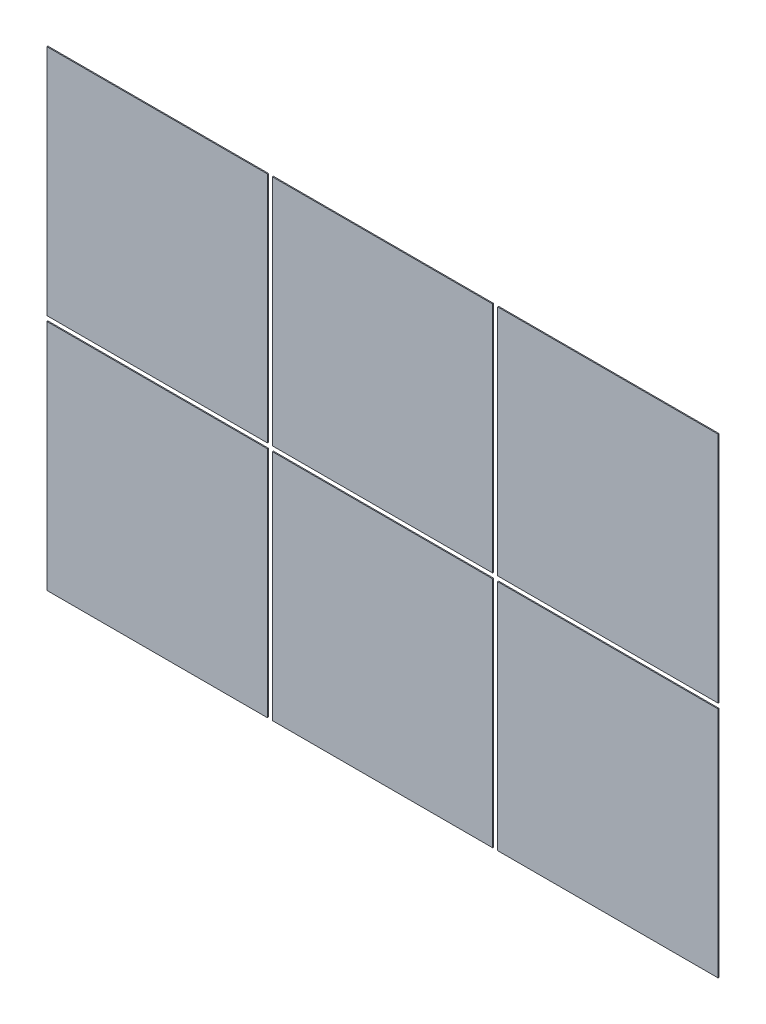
ISO-10303-21;
HEADER;
FILE_DESCRIPTION(('STEP AP214'),'2;1');
FILE_NAME('part.step','',(''),(''),'','','');
FILE_SCHEMA(('AUTOMOTIVE_DESIGN { 1 0 10303 214 1 1 1 1 }'));
ENDSEC;
DATA;
#1=APPLICATION_CONTEXT('core data for automotive mechanical design processes');
#2=APPLICATION_PROTOCOL_DEFINITION('international standard','automotive_design',2000,#1);
#3=PRODUCT_CONTEXT('',#1,'mechanical');
#4=PRODUCT('Part','Part','',(#3));
#5=PRODUCT_RELATED_PRODUCT_CATEGORY('part','',(#4));
#6=PRODUCT_DEFINITION_FORMATION('','',#4);
#7=PRODUCT_DEFINITION_CONTEXT('part definition',#1,'design');
#8=PRODUCT_DEFINITION('design','',#6,#7);
#9=PRODUCT_DEFINITION_SHAPE('','',#8);
#10=(LENGTH_UNIT() NAMED_UNIT(*) SI_UNIT(.MILLI.,.METRE.));
#11=(NAMED_UNIT(*) PLANE_ANGLE_UNIT() SI_UNIT($,.RADIAN.));
#12=(NAMED_UNIT(*) SI_UNIT($,.STERADIAN.) SOLID_ANGLE_UNIT());
#13=UNCERTAINTY_MEASURE_WITH_UNIT(LENGTH_MEASURE(1.E-05),#10,'distance_accuracy_value','');
#14=(GEOMETRIC_REPRESENTATION_CONTEXT(3) GLOBAL_UNCERTAINTY_ASSIGNED_CONTEXT((#13)) GLOBAL_UNIT_ASSIGNED_CONTEXT((#10,
#11,#12)) REPRESENTATION_CONTEXT('',''));
#15=CARTESIAN_POINT('',(0.,0.,0.));
#16=DIRECTION('',(0.,0.,1.));
#17=DIRECTION('',(1.,0.,0.));
#18=AXIS2_PLACEMENT_3D('',#15,#16,#17);
#19=CARTESIAN_POINT('',(-460.,-960.,0.0999999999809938));
#20=DIRECTION('',(-1.,0.,0.));
#21=DIRECTION('',(0.,0.,1.));
#22=AXIS2_PLACEMENT_3D('',#19,#20,#21);
#23=PLANE('',#22);
#24=DIRECTION('',(0.,-1.,0.));
#25=VECTOR('',#24,1.);
#26=CARTESIAN_POINT('',(-460.,-960.,4.09999999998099));
#27=LINE('',#26,#25);
#28=CARTESIAN_POINT('',(-460.,-960.,4.09999999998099));
#29=VERTEX_POINT('',#28);
#30=CARTESIAN_POINT('',(-460.,-1890.,4.09999999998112));
#31=VERTEX_POINT('',#30);
#32=EDGE_CURVE('E113',#29,#31,#27,.T.);
#33=ORIENTED_EDGE('',*,*,#32,.T.);
#34=DIRECTION('',(0.,0.,1.));
#35=VECTOR('',#34,1.);
#36=CARTESIAN_POINT('',(-460.,-1890.,0.0999999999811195));
#37=LINE('',#36,#35);
#38=CARTESIAN_POINT('',(-460.,-1890.,0.0999999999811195));
#39=VERTEX_POINT('',#38);
#40=EDGE_CURVE('E12',#39,#31,#37,.T.);
#41=ORIENTED_EDGE('',*,*,#40,.F.);
#42=DIRECTION('',(0.,-1.,0.));
#43=VECTOR('',#42,1.);
#44=CARTESIAN_POINT('',(-460.,-960.,0.0999999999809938));
#45=LINE('',#44,#43);
#46=CARTESIAN_POINT('',(-460.,-960.,0.0999999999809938));
#47=VERTEX_POINT('',#46);
#48=EDGE_CURVE('E101',#47,#39,#45,.T.);
#49=ORIENTED_EDGE('',*,*,#48,.F.);
#50=DIRECTION('',(0.,0.,1.));
#51=VECTOR('',#50,1.);
#52=CARTESIAN_POINT('',(-460.,-960.,0.0999999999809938));
#53=LINE('',#52,#51);
#54=EDGE_CURVE('E109',#47,#29,#53,.T.);
#55=ORIENTED_EDGE('',*,*,#54,.T.);
#56=EDGE_LOOP('',(#33,#41,#49,#55));
#57=FACE_BOUND('',#56,.T.);
#58=ADVANCED_FACE('F50',(#57),#23,.F.);
#59=CARTESIAN_POINT('',(-460.,-1890.,0.0999999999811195));
#60=DIRECTION('',(0.,1.,0.));
#61=DIRECTION('',(0.,0.,1.));
#62=AXIS2_PLACEMENT_3D('',#59,#60,#61);
#63=PLANE('',#62);
#64=DIRECTION('',(-1.,0.,0.));
#65=VECTOR('',#64,1.);
#66=CARTESIAN_POINT('',(-460.,-1890.,4.09999999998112));
#67=LINE('',#66,#65);
#68=CARTESIAN_POINT('',(-1340.,-1890.,4.09999999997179));
#69=VERTEX_POINT('',#68);
#70=EDGE_CURVE('E105',#31,#69,#67,.T.);
#71=ORIENTED_EDGE('',*,*,#70,.T.);
#72=DIRECTION('',(0.,0.,1.));
#73=VECTOR('',#72,1.);
#74=CARTESIAN_POINT('',(-1340.,-1890.,0.0999999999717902));
#75=LINE('',#74,#73);
#76=CARTESIAN_POINT('',(-1340.,-1890.,0.0999999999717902));
#77=VERTEX_POINT('',#76);
#78=EDGE_CURVE('E58',#77,#69,#75,.T.);
#79=ORIENTED_EDGE('',*,*,#78,.F.);
#80=DIRECTION('',(-1.,0.,0.));
#81=VECTOR('',#80,1.);
#82=CARTESIAN_POINT('',(-460.,-1890.,0.0999999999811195));
#83=LINE('',#82,#81);
#84=EDGE_CURVE('E96',#39,#77,#83,.T.);
#85=ORIENTED_EDGE('',*,*,#84,.F.);
#86=ORIENTED_EDGE('',*,*,#40,.T.);
#87=EDGE_LOOP('',(#71,#79,#85,#86));
#88=FACE_BOUND('',#87,.T.);
#89=ADVANCED_FACE('F104',(#88),#63,.F.);
#90=CARTESIAN_POINT('',(-1340.,-960.,0.0999999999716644));
#91=DIRECTION('',(1.,0.,0.));
#92=DIRECTION('',(0.,0.,-1.));
#93=AXIS2_PLACEMENT_3D('',#90,#91,#92);
#94=PLANE('',#93);
#95=DIRECTION('',(0.,1.,0.));
#96=VECTOR('',#95,1.);
#97=CARTESIAN_POINT('',(-1340.,-960.,4.09999999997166));
#98=LINE('',#97,#96);
#99=CARTESIAN_POINT('',(-1340.,-960.,4.09999999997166));
#100=VERTEX_POINT('',#99);
#101=EDGE_CURVE('E83',#69,#100,#98,.T.);
#102=ORIENTED_EDGE('',*,*,#101,.T.);
#103=DIRECTION('',(0.,0.,1.));
#104=VECTOR('',#103,1.);
#105=CARTESIAN_POINT('',(-1340.,-960.,0.0999999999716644));
#106=LINE('',#105,#104);
#107=CARTESIAN_POINT('',(-1340.,-960.,0.0999999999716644));
#108=VERTEX_POINT('',#107);
#109=EDGE_CURVE('E106',#108,#100,#106,.T.);
#110=ORIENTED_EDGE('',*,*,#109,.F.);
#111=DIRECTION('',(0.,1.,0.));
#112=VECTOR('',#111,1.);
#113=CARTESIAN_POINT('',(-1340.,-960.,0.0999999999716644));
#114=LINE('',#113,#112);
#115=EDGE_CURVE('E99',#77,#108,#114,.T.);
#116=ORIENTED_EDGE('',*,*,#115,.F.);
#117=ORIENTED_EDGE('',*,*,#78,.T.);
#118=EDGE_LOOP('',(#102,#110,#116,#117));
#119=FACE_BOUND('',#118,.T.);
#120=ADVANCED_FACE('F107',(#119),#94,.F.);
#121=CARTESIAN_POINT('',(-460.,-960.,0.0999999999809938));
#122=DIRECTION('',(0.,-1.,0.));
#123=DIRECTION('',(0.,0.,-1.));
#124=AXIS2_PLACEMENT_3D('',#121,#122,#123);
#125=PLANE('',#124);
#126=DIRECTION('',(1.,0.,0.));
#127=VECTOR('',#126,1.);
#128=CARTESIAN_POINT('',(-460.,-960.,4.09999999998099));
#129=LINE('',#128,#127);
#130=EDGE_CURVE('E89',#100,#29,#129,.T.);
#131=ORIENTED_EDGE('',*,*,#130,.T.);
#132=ORIENTED_EDGE('',*,*,#54,.F.);
#133=DIRECTION('',(1.,0.,0.));
#134=VECTOR('',#133,1.);
#135=CARTESIAN_POINT('',(-460.,-960.,0.0999999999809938));
#136=LINE('',#135,#134);
#137=EDGE_CURVE('E66',#108,#47,#136,.T.);
#138=ORIENTED_EDGE('',*,*,#137,.F.);
#139=ORIENTED_EDGE('',*,*,#109,.T.);
#140=EDGE_LOOP('',(#131,#132,#138,#139));
#141=FACE_BOUND('',#140,.T.);
#142=ADVANCED_FACE('F120',(#141),#125,.F.);
#143=CARTESIAN_POINT('',(0.,0.,0.0999999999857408));
#144=DIRECTION('',(0.,0.,-1.));
#145=DIRECTION('',(-1.,0.,0.));
#146=AXIS2_PLACEMENT_3D('',#143,#144,#145);
#147=PLANE('',#146);
#148=ORIENTED_EDGE('',*,*,#48,.T.);
#149=ORIENTED_EDGE('',*,*,#84,.T.);
#150=ORIENTED_EDGE('',*,*,#115,.T.);
#151=ORIENTED_EDGE('',*,*,#137,.T.);
#152=EDGE_LOOP('',(#148,#149,#150,#151));
#153=FACE_BOUND('',#152,.T.);
#154=ADVANCED_FACE('F97',(#153),#147,.T.);
#155=CARTESIAN_POINT('',(0.,0.,4.09999999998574));
#156=DIRECTION('',(0.,0.,-1.));
#157=DIRECTION('',(-1.,0.,0.));
#158=AXIS2_PLACEMENT_3D('',#155,#156,#157);
#159=PLANE('',#158);
#160=ORIENTED_EDGE('',*,*,#32,.F.);
#161=ORIENTED_EDGE('',*,*,#130,.F.);
#162=ORIENTED_EDGE('',*,*,#101,.F.);
#163=ORIENTED_EDGE('',*,*,#70,.F.);
#164=EDGE_LOOP('',(#160,#161,#162,#163));
#165=FACE_BOUND('',#164,.T.);
#166=ADVANCED_FACE('F123',(#165),#159,.F.);
#167=CLOSED_SHELL('',(#58,#89,#120,#142,#154,#166));
#168=MANIFOLD_SOLID_BREP('B2',#167);
#169=CARTESIAN_POINT('',(440.,-1890.,0.0999999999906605));
#170=DIRECTION('',(-1.,0.,0.));
#171=DIRECTION('',(0.,0.,1.));
#172=AXIS2_PLACEMENT_3D('',#169,#170,#171);
#173=PLANE('',#172);
#174=DIRECTION('',(0.,-1.,0.));
#175=VECTOR('',#174,1.);
#176=CARTESIAN_POINT('',(440.,-1890.,4.09999999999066));
#177=LINE('',#176,#175);
#178=CARTESIAN_POINT('',(440.,-960.,4.09999999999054));
#179=VERTEX_POINT('',#178);
#180=CARTESIAN_POINT('',(440.,-1890.,4.09999999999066));
#181=VERTEX_POINT('',#180);
#182=EDGE_CURVE('E247',#179,#181,#177,.T.);
#183=ORIENTED_EDGE('',*,*,#182,.T.);
#184=DIRECTION('',(0.,0.,1.));
#185=VECTOR('',#184,1.);
#186=CARTESIAN_POINT('',(440.,-1890.,0.0999999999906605));
#187=LINE('',#186,#185);
#188=CARTESIAN_POINT('',(440.,-1890.,0.0999999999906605));
#189=VERTEX_POINT('',#188);
#190=EDGE_CURVE('E48',#189,#181,#187,.T.);
#191=ORIENTED_EDGE('',*,*,#190,.F.);
#192=DIRECTION('',(0.,-1.,0.));
#193=VECTOR('',#192,1.);
#194=CARTESIAN_POINT('',(440.,-1890.,0.0999999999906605));
#195=LINE('',#194,#193);
#196=CARTESIAN_POINT('',(440.,-960.,0.0999999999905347));
#197=VERTEX_POINT('',#196);
#198=EDGE_CURVE('E235',#197,#189,#195,.T.);
#199=ORIENTED_EDGE('',*,*,#198,.F.);
#200=DIRECTION('',(0.,0.,1.));
#201=VECTOR('',#200,1.);
#202=CARTESIAN_POINT('',(440.,-960.,0.0999999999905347));
#203=LINE('',#202,#201);
#204=EDGE_CURVE('E243',#197,#179,#203,.T.);
#205=ORIENTED_EDGE('',*,*,#204,.T.);
#206=EDGE_LOOP('',(#183,#191,#199,#205));
#207=FACE_BOUND('',#206,.T.);
#208=ADVANCED_FACE('F184',(#207),#173,.F.);
#209=CARTESIAN_POINT('',(440.,-1890.,0.0999999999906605));
#210=DIRECTION('',(0.,1.,0.));
#211=DIRECTION('',(0.,0.,1.));
#212=AXIS2_PLACEMENT_3D('',#209,#210,#211);
#213=PLANE('',#212);
#214=DIRECTION('',(-1.,0.,0.));
#215=VECTOR('',#214,1.);
#216=CARTESIAN_POINT('',(440.,-1890.,4.09999999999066));
#217=LINE('',#216,#215);
#218=CARTESIAN_POINT('',(-440.,-1890.,4.09999999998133));
#219=VERTEX_POINT('',#218);
#220=EDGE_CURVE('E239',#181,#219,#217,.T.);
#221=ORIENTED_EDGE('',*,*,#220,.T.);
#222=DIRECTION('',(0.,0.,1.));
#223=VECTOR('',#222,1.);
#224=CARTESIAN_POINT('',(-440.,-1890.,0.0999999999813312));
#225=LINE('',#224,#223);
#226=CARTESIAN_POINT('',(-440.,-1890.,0.0999999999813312));
#227=VERTEX_POINT('',#226);
#228=EDGE_CURVE('E192',#227,#219,#225,.T.);
#229=ORIENTED_EDGE('',*,*,#228,.F.);
#230=DIRECTION('',(-1.,0.,0.));
#231=VECTOR('',#230,1.);
#232=CARTESIAN_POINT('',(440.,-1890.,0.0999999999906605));
#233=LINE('',#232,#231);
#234=EDGE_CURVE('E230',#189,#227,#233,.T.);
#235=ORIENTED_EDGE('',*,*,#234,.F.);
#236=ORIENTED_EDGE('',*,*,#190,.T.);
#237=EDGE_LOOP('',(#221,#229,#235,#236));
#238=FACE_BOUND('',#237,.T.);
#239=ADVANCED_FACE('F238',(#238),#213,.F.);
#240=CARTESIAN_POINT('',(-440.,-1890.,0.0999999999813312));
#241=DIRECTION('',(1.,0.,0.));
#242=DIRECTION('',(0.,0.,-1.));
#243=AXIS2_PLACEMENT_3D('',#240,#241,#242);
#244=PLANE('',#243);
#245=DIRECTION('',(0.,1.,0.));
#246=VECTOR('',#245,1.);
#247=CARTESIAN_POINT('',(-440.,-1890.,4.09999999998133));
#248=LINE('',#247,#246);
#249=CARTESIAN_POINT('',(-440.,-960.,4.09999999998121));
#250=VERTEX_POINT('',#249);
#251=EDGE_CURVE('E217',#219,#250,#248,.T.);
#252=ORIENTED_EDGE('',*,*,#251,.T.);
#253=DIRECTION('',(0.,0.,1.));
#254=VECTOR('',#253,1.);
#255=CARTESIAN_POINT('',(-440.,-960.,0.0999999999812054));
#256=LINE('',#255,#254);
#257=CARTESIAN_POINT('',(-440.,-960.,0.0999999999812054));
#258=VERTEX_POINT('',#257);
#259=EDGE_CURVE('E240',#258,#250,#256,.T.);
#260=ORIENTED_EDGE('',*,*,#259,.F.);
#261=DIRECTION('',(0.,1.,0.));
#262=VECTOR('',#261,1.);
#263=CARTESIAN_POINT('',(-440.,-1890.,0.0999999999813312));
#264=LINE('',#263,#262);
#265=EDGE_CURVE('E233',#227,#258,#264,.T.);
#266=ORIENTED_EDGE('',*,*,#265,.F.);
#267=ORIENTED_EDGE('',*,*,#228,.T.);
#268=EDGE_LOOP('',(#252,#260,#266,#267));
#269=FACE_BOUND('',#268,.T.);
#270=ADVANCED_FACE('F241',(#269),#244,.F.);
#271=CARTESIAN_POINT('',(440.,-960.,0.0999999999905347));
#272=DIRECTION('',(0.,-1.,0.));
#273=DIRECTION('',(0.,0.,-1.));
#274=AXIS2_PLACEMENT_3D('',#271,#272,#273);
#275=PLANE('',#274);
#276=DIRECTION('',(1.,0.,0.));
#277=VECTOR('',#276,1.);
#278=CARTESIAN_POINT('',(440.,-960.,4.09999999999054));
#279=LINE('',#278,#277);
#280=EDGE_CURVE('E223',#250,#179,#279,.T.);
#281=ORIENTED_EDGE('',*,*,#280,.T.);
#282=ORIENTED_EDGE('',*,*,#204,.F.);
#283=DIRECTION('',(1.,0.,0.));
#284=VECTOR('',#283,1.);
#285=CARTESIAN_POINT('',(440.,-960.,0.0999999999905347));
#286=LINE('',#285,#284);
#287=EDGE_CURVE('E200',#258,#197,#286,.T.);
#288=ORIENTED_EDGE('',*,*,#287,.F.);
#289=ORIENTED_EDGE('',*,*,#259,.T.);
#290=EDGE_LOOP('',(#281,#282,#288,#289));
#291=FACE_BOUND('',#290,.T.);
#292=ADVANCED_FACE('F254',(#291),#275,.F.);
#293=CARTESIAN_POINT('',(0.,0.,0.09999999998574));
#294=DIRECTION('',(0.,0.,1.));
#295=DIRECTION('',(1.,0.,0.));
#296=AXIS2_PLACEMENT_3D('',#293,#294,#295);
#297=PLANE('',#296);
#298=ORIENTED_EDGE('',*,*,#198,.T.);
#299=ORIENTED_EDGE('',*,*,#234,.T.);
#300=ORIENTED_EDGE('',*,*,#265,.T.);
#301=ORIENTED_EDGE('',*,*,#287,.T.);
#302=EDGE_LOOP('',(#298,#299,#300,#301));
#303=FACE_BOUND('',#302,.T.);
#304=ADVANCED_FACE('F231',(#303),#297,.F.);
#305=CARTESIAN_POINT('',(0.,0.,4.09999999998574));
#306=DIRECTION('',(0.,0.,1.));
#307=DIRECTION('',(1.,0.,0.));
#308=AXIS2_PLACEMENT_3D('',#305,#306,#307);
#309=PLANE('',#308);
#310=ORIENTED_EDGE('',*,*,#182,.F.);
#311=ORIENTED_EDGE('',*,*,#280,.F.);
#312=ORIENTED_EDGE('',*,*,#251,.F.);
#313=ORIENTED_EDGE('',*,*,#220,.F.);
#314=EDGE_LOOP('',(#310,#311,#312,#313));
#315=FACE_BOUND('',#314,.T.);
#316=ADVANCED_FACE('F257',(#315),#309,.T.);
#317=CLOSED_SHELL('',(#208,#239,#270,#292,#304,#316));
#318=MANIFOLD_SOLID_BREP('B6',#317);
#319=CARTESIAN_POINT('',(1340.,-960.,0.100000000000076));
#320=DIRECTION('',(-1.,0.,0.));
#321=DIRECTION('',(0.,0.,1.));
#322=AXIS2_PLACEMENT_3D('',#319,#320,#321);
#323=PLANE('',#322);
#324=DIRECTION('',(0.,-1.,0.));
#325=VECTOR('',#324,1.);
#326=CARTESIAN_POINT('',(1340.,-960.,4.10000000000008));
#327=LINE('',#326,#325);
#328=CARTESIAN_POINT('',(1340.,-960.,4.10000000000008));
#329=VERTEX_POINT('',#328);
#330=CARTESIAN_POINT('',(1340.,-1890.,4.1000000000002));
#331=VERTEX_POINT('',#330);
#332=EDGE_CURVE('E381',#329,#331,#327,.T.);
#333=ORIENTED_EDGE('',*,*,#332,.T.);
#334=DIRECTION('',(0.,0.,1.));
#335=VECTOR('',#334,1.);
#336=CARTESIAN_POINT('',(1340.,-1890.,0.100000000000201));
#337=LINE('',#336,#335);
#338=CARTESIAN_POINT('',(1340.,-1890.,0.100000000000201));
#339=VERTEX_POINT('',#338);
#340=EDGE_CURVE('E182',#339,#331,#337,.T.);
#341=ORIENTED_EDGE('',*,*,#340,.F.);
#342=DIRECTION('',(0.,-1.,0.));
#343=VECTOR('',#342,1.);
#344=CARTESIAN_POINT('',(1340.,-960.,0.100000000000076));
#345=LINE('',#344,#343);
#346=CARTESIAN_POINT('',(1340.,-960.,0.100000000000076));
#347=VERTEX_POINT('',#346);
#348=EDGE_CURVE('E369',#347,#339,#345,.T.);
#349=ORIENTED_EDGE('',*,*,#348,.F.);
#350=DIRECTION('',(0.,0.,1.));
#351=VECTOR('',#350,1.);
#352=CARTESIAN_POINT('',(1340.,-960.,0.100000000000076));
#353=LINE('',#352,#351);
#354=EDGE_CURVE('E377',#347,#329,#353,.T.);
#355=ORIENTED_EDGE('',*,*,#354,.T.);
#356=EDGE_LOOP('',(#333,#341,#349,#355));
#357=FACE_BOUND('',#356,.T.);
#358=ADVANCED_FACE('F318',(#357),#323,.F.);
#359=CARTESIAN_POINT('',(1340.,-1890.,0.100000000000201));
#360=DIRECTION('',(0.,1.,0.));
#361=DIRECTION('',(0.,0.,1.));
#362=AXIS2_PLACEMENT_3D('',#359,#360,#361);
#363=PLANE('',#362);
#364=DIRECTION('',(-1.,0.,0.));
#365=VECTOR('',#364,1.);
#366=CARTESIAN_POINT('',(1340.,-1890.,4.1000000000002));
#367=LINE('',#366,#365);
#368=CARTESIAN_POINT('',(460.,-1890.,4.09999999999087));
#369=VERTEX_POINT('',#368);
#370=EDGE_CURVE('E373',#331,#369,#367,.T.);
#371=ORIENTED_EDGE('',*,*,#370,.T.);
#372=DIRECTION('',(0.,0.,1.));
#373=VECTOR('',#372,1.);
#374=CARTESIAN_POINT('',(460.,-1890.,0.0999999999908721));
#375=LINE('',#374,#373);
#376=CARTESIAN_POINT('',(460.,-1890.,0.0999999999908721));
#377=VERTEX_POINT('',#376);
#378=EDGE_CURVE('E326',#377,#369,#375,.T.);
#379=ORIENTED_EDGE('',*,*,#378,.F.);
#380=DIRECTION('',(-1.,0.,0.));
#381=VECTOR('',#380,1.);
#382=CARTESIAN_POINT('',(1340.,-1890.,0.100000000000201));
#383=LINE('',#382,#381);
#384=EDGE_CURVE('E364',#339,#377,#383,.T.);
#385=ORIENTED_EDGE('',*,*,#384,.F.);
#386=ORIENTED_EDGE('',*,*,#340,.T.);
#387=EDGE_LOOP('',(#371,#379,#385,#386));
#388=FACE_BOUND('',#387,.T.);
#389=ADVANCED_FACE('F372',(#388),#363,.F.);
#390=CARTESIAN_POINT('',(460.,-960.,0.0999999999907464));
#391=DIRECTION('',(1.,0.,0.));
#392=DIRECTION('',(0.,0.,-1.));
#393=AXIS2_PLACEMENT_3D('',#390,#391,#392);
#394=PLANE('',#393);
#395=DIRECTION('',(0.,1.,0.));
#396=VECTOR('',#395,1.);
#397=CARTESIAN_POINT('',(460.,-960.,4.09999999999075));
#398=LINE('',#397,#396);
#399=CARTESIAN_POINT('',(460.,-960.,4.09999999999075));
#400=VERTEX_POINT('',#399);
#401=EDGE_CURVE('E351',#369,#400,#398,.T.);
#402=ORIENTED_EDGE('',*,*,#401,.T.);
#403=DIRECTION('',(0.,0.,1.));
#404=VECTOR('',#403,1.);
#405=CARTESIAN_POINT('',(460.,-960.,0.0999999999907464));
#406=LINE('',#405,#404);
#407=CARTESIAN_POINT('',(460.,-960.,0.0999999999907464));
#408=VERTEX_POINT('',#407);
#409=EDGE_CURVE('E374',#408,#400,#406,.T.);
#410=ORIENTED_EDGE('',*,*,#409,.F.);
#411=DIRECTION('',(0.,1.,0.));
#412=VECTOR('',#411,1.);
#413=CARTESIAN_POINT('',(460.,-960.,0.0999999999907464));
#414=LINE('',#413,#412);
#415=EDGE_CURVE('E367',#377,#408,#414,.T.);
#416=ORIENTED_EDGE('',*,*,#415,.F.);
#417=ORIENTED_EDGE('',*,*,#378,.T.);
#418=EDGE_LOOP('',(#402,#410,#416,#417));
#419=FACE_BOUND('',#418,.T.);
#420=ADVANCED_FACE('F375',(#419),#394,.F.);
#421=CARTESIAN_POINT('',(1340.,-960.,0.100000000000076));
#422=DIRECTION('',(0.,-1.,0.));
#423=DIRECTION('',(0.,0.,-1.));
#424=AXIS2_PLACEMENT_3D('',#421,#422,#423);
#425=PLANE('',#424);
#426=DIRECTION('',(1.,0.,0.));
#427=VECTOR('',#426,1.);
#428=CARTESIAN_POINT('',(1340.,-960.,4.10000000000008));
#429=LINE('',#428,#427);
#430=EDGE_CURVE('E357',#400,#329,#429,.T.);
#431=ORIENTED_EDGE('',*,*,#430,.T.);
#432=ORIENTED_EDGE('',*,*,#354,.F.);
#433=DIRECTION('',(1.,0.,0.));
#434=VECTOR('',#433,1.);
#435=CARTESIAN_POINT('',(1340.,-960.,0.100000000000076));
#436=LINE('',#435,#434);
#437=EDGE_CURVE('E334',#408,#347,#436,.T.);
#438=ORIENTED_EDGE('',*,*,#437,.F.);
#439=ORIENTED_EDGE('',*,*,#409,.T.);
#440=EDGE_LOOP('',(#431,#432,#438,#439));
#441=FACE_BOUND('',#440,.T.);
#442=ADVANCED_FACE('F388',(#441),#425,.F.);
#443=CARTESIAN_POINT('',(0.,0.,0.09999999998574));
#444=DIRECTION('',(0.,0.,-1.));
#445=DIRECTION('',(-1.,0.,0.));
#446=AXIS2_PLACEMENT_3D('',#443,#444,#445);
#447=PLANE('',#446);
#448=ORIENTED_EDGE('',*,*,#348,.T.);
#449=ORIENTED_EDGE('',*,*,#384,.T.);
#450=ORIENTED_EDGE('',*,*,#415,.T.);
#451=ORIENTED_EDGE('',*,*,#437,.T.);
#452=EDGE_LOOP('',(#448,#449,#450,#451));
#453=FACE_BOUND('',#452,.T.);
#454=ADVANCED_FACE('F365',(#453),#447,.T.);
#455=CARTESIAN_POINT('',(0.,0.,4.09999999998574));
#456=DIRECTION('',(0.,0.,-1.));
#457=DIRECTION('',(-1.,0.,0.));
#458=AXIS2_PLACEMENT_3D('',#455,#456,#457);
#459=PLANE('',#458);
#460=ORIENTED_EDGE('',*,*,#332,.F.);
#461=ORIENTED_EDGE('',*,*,#430,.F.);
#462=ORIENTED_EDGE('',*,*,#401,.F.);
#463=ORIENTED_EDGE('',*,*,#370,.F.);
#464=EDGE_LOOP('',(#460,#461,#462,#463));
#465=FACE_BOUND('',#464,.T.);
#466=ADVANCED_FACE('F391',(#465),#459,.F.);
#467=CLOSED_SHELL('',(#358,#389,#420,#442,#454,#466));
#468=MANIFOLD_SOLID_BREP('B42',#467);
#469=CARTESIAN_POINT('',(-460.,-940.,0.0999999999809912));
#470=DIRECTION('',(-1.,0.,0.));
#471=DIRECTION('',(0.,0.,1.));
#472=AXIS2_PLACEMENT_3D('',#469,#470,#471);
#473=PLANE('',#472);
#474=DIRECTION('',(0.,-1.,0.));
#475=VECTOR('',#474,1.);
#476=CARTESIAN_POINT('',(-460.,-940.,4.09999999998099));
#477=LINE('',#476,#475);
#478=CARTESIAN_POINT('',(-460.,-10.0000000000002,4.09999999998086));
#479=VERTEX_POINT('',#478);
#480=CARTESIAN_POINT('',(-460.,-940.,4.09999999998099));
#481=VERTEX_POINT('',#480);
#482=EDGE_CURVE('E515',#479,#481,#477,.T.);
#483=ORIENTED_EDGE('',*,*,#482,.T.);
#484=DIRECTION('',(0.,0.,1.));
#485=VECTOR('',#484,1.);
#486=CARTESIAN_POINT('',(-460.,-940.,0.0999999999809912));
#487=LINE('',#486,#485);
#488=CARTESIAN_POINT('',(-460.,-940.,0.0999999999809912));
#489=VERTEX_POINT('',#488);
#490=EDGE_CURVE('E316',#489,#481,#487,.T.);
#491=ORIENTED_EDGE('',*,*,#490,.F.);
#492=DIRECTION('',(0.,-1.,0.));
#493=VECTOR('',#492,1.);
#494=CARTESIAN_POINT('',(-460.,-940.,0.0999999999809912));
#495=LINE('',#494,#493);
#496=CARTESIAN_POINT('',(-460.,-10.0000000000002,0.0999999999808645));
#497=VERTEX_POINT('',#496);
#498=EDGE_CURVE('E503',#497,#489,#495,.T.);
#499=ORIENTED_EDGE('',*,*,#498,.F.);
#500=DIRECTION('',(0.,0.,1.));
#501=VECTOR('',#500,1.);
#502=CARTESIAN_POINT('',(-460.,-10.0000000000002,0.0999999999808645));
#503=LINE('',#502,#501);
#504=EDGE_CURVE('E511',#497,#479,#503,.T.);
#505=ORIENTED_EDGE('',*,*,#504,.T.);
#506=EDGE_LOOP('',(#483,#491,#499,#505));
#507=FACE_BOUND('',#506,.T.);
#508=ADVANCED_FACE('F452',(#507),#473,.F.);
#509=CARTESIAN_POINT('',(-460.,-940.,0.0999999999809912));
#510=DIRECTION('',(0.,1.,0.));
#511=DIRECTION('',(0.,0.,1.));
#512=AXIS2_PLACEMENT_3D('',#509,#510,#511);
#513=PLANE('',#512);
#514=DIRECTION('',(-1.,0.,0.));
#515=VECTOR('',#514,1.);
#516=CARTESIAN_POINT('',(-460.,-940.,4.09999999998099));
#517=LINE('',#516,#515);
#518=CARTESIAN_POINT('',(-1340.,-940.,4.09999999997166));
#519=VERTEX_POINT('',#518);
#520=EDGE_CURVE('E507',#481,#519,#517,.T.);
#521=ORIENTED_EDGE('',*,*,#520,.T.);
#522=DIRECTION('',(0.,0.,1.));
#523=VECTOR('',#522,1.);
#524=CARTESIAN_POINT('',(-1340.,-940.,0.0999999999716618));
#525=LINE('',#524,#523);
#526=CARTESIAN_POINT('',(-1340.,-940.,0.0999999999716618));
#527=VERTEX_POINT('',#526);
#528=EDGE_CURVE('E460',#527,#519,#525,.T.);
#529=ORIENTED_EDGE('',*,*,#528,.F.);
#530=DIRECTION('',(-1.,0.,0.));
#531=VECTOR('',#530,1.);
#532=CARTESIAN_POINT('',(-460.,-940.,0.0999999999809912));
#533=LINE('',#532,#531);
#534=EDGE_CURVE('E498',#489,#527,#533,.T.);
#535=ORIENTED_EDGE('',*,*,#534,.F.);
#536=ORIENTED_EDGE('',*,*,#490,.T.);
#537=EDGE_LOOP('',(#521,#529,#535,#536));
#538=FACE_BOUND('',#537,.T.);
#539=ADVANCED_FACE('F506',(#538),#513,.F.);
#540=CARTESIAN_POINT('',(-1340.,-940.,0.0999999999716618));
#541=DIRECTION('',(1.,0.,0.));
#542=DIRECTION('',(0.,0.,-1.));
#543=AXIS2_PLACEMENT_3D('',#540,#541,#542);
#544=PLANE('',#543);
#545=DIRECTION('',(0.,1.,0.));
#546=VECTOR('',#545,1.);
#547=CARTESIAN_POINT('',(-1340.,-940.,4.09999999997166));
#548=LINE('',#547,#546);
#549=CARTESIAN_POINT('',(-1340.,-10.0000000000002,4.09999999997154));
#550=VERTEX_POINT('',#549);
#551=EDGE_CURVE('E485',#519,#550,#548,.T.);
#552=ORIENTED_EDGE('',*,*,#551,.T.);
#553=DIRECTION('',(0.,0.,1.));
#554=VECTOR('',#553,1.);
#555=CARTESIAN_POINT('',(-1340.,-10.0000000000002,0.0999999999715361));
#556=LINE('',#555,#554);
#557=CARTESIAN_POINT('',(-1340.,-10.0000000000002,0.0999999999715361));
#558=VERTEX_POINT('',#557);
#559=EDGE_CURVE('E508',#558,#550,#556,.T.);
#560=ORIENTED_EDGE('',*,*,#559,.F.);
#561=DIRECTION('',(0.,1.,0.));
#562=VECTOR('',#561,1.);
#563=CARTESIAN_POINT('',(-1340.,-940.,0.0999999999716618));
#564=LINE('',#563,#562);
#565=EDGE_CURVE('E501',#527,#558,#564,.T.);
#566=ORIENTED_EDGE('',*,*,#565,.F.);
#567=ORIENTED_EDGE('',*,*,#528,.T.);
#568=EDGE_LOOP('',(#552,#560,#566,#567));
#569=FACE_BOUND('',#568,.T.);
#570=ADVANCED_FACE('F509',(#569),#544,.F.);
#571=CARTESIAN_POINT('',(-460.,-10.0000000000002,0.0999999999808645));
#572=DIRECTION('',(0.,-1.,0.));
#573=DIRECTION('',(0.,0.,-1.));
#574=AXIS2_PLACEMENT_3D('',#571,#572,#573);
#575=PLANE('',#574);
#576=DIRECTION('',(1.,0.,0.));
#577=VECTOR('',#576,1.);
#578=CARTESIAN_POINT('',(-460.,-10.0000000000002,4.09999999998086));
#579=LINE('',#578,#577);
#580=EDGE_CURVE('E491',#550,#479,#579,.T.);
#581=ORIENTED_EDGE('',*,*,#580,.T.);
#582=ORIENTED_EDGE('',*,*,#504,.F.);
#583=DIRECTION('',(1.,0.,0.));
#584=VECTOR('',#583,1.);
#585=CARTESIAN_POINT('',(-460.,-10.0000000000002,0.0999999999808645));
#586=LINE('',#585,#584);
#587=EDGE_CURVE('E468',#558,#497,#586,.T.);
#588=ORIENTED_EDGE('',*,*,#587,.F.);
#589=ORIENTED_EDGE('',*,*,#559,.T.);
#590=EDGE_LOOP('',(#581,#582,#588,#589));
#591=FACE_BOUND('',#590,.T.);
#592=ADVANCED_FACE('F522',(#591),#575,.F.);
#593=CARTESIAN_POINT('',(0.,0.,0.0999999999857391));
#594=DIRECTION('',(0.,0.,1.));
#595=DIRECTION('',(1.,0.,0.));
#596=AXIS2_PLACEMENT_3D('',#593,#594,#595);
#597=PLANE('',#596);
#598=ORIENTED_EDGE('',*,*,#498,.T.);
#599=ORIENTED_EDGE('',*,*,#534,.T.);
#600=ORIENTED_EDGE('',*,*,#565,.T.);
#601=ORIENTED_EDGE('',*,*,#587,.T.);
#602=EDGE_LOOP('',(#598,#599,#600,#601));
#603=FACE_BOUND('',#602,.T.);
#604=ADVANCED_FACE('F499',(#603),#597,.F.);
#605=CARTESIAN_POINT('',(0.,0.,4.09999999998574));
#606=DIRECTION('',(0.,0.,1.));
#607=DIRECTION('',(1.,0.,0.));
#608=AXIS2_PLACEMENT_3D('',#605,#606,#607);
#609=PLANE('',#608);
#610=ORIENTED_EDGE('',*,*,#482,.F.);
#611=ORIENTED_EDGE('',*,*,#580,.F.);
#612=ORIENTED_EDGE('',*,*,#551,.F.);
#613=ORIENTED_EDGE('',*,*,#520,.F.);
#614=EDGE_LOOP('',(#610,#611,#612,#613));
#615=FACE_BOUND('',#614,.T.);
#616=ADVANCED_FACE('F525',(#615),#609,.T.);
#617=CLOSED_SHELL('',(#508,#539,#570,#592,#604,#616));
#618=MANIFOLD_SOLID_BREP('B176',#617);
#619=CARTESIAN_POINT('',(440.,-10.,0.0999999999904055));
#620=DIRECTION('',(-1.,0.,0.));
#621=DIRECTION('',(0.,0.,1.));
#622=AXIS2_PLACEMENT_3D('',#619,#620,#621);
#623=PLANE('',#622);
#624=DIRECTION('',(0.,-1.,0.));
#625=VECTOR('',#624,1.);
#626=CARTESIAN_POINT('',(440.,-10.,4.09999999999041));
#627=LINE('',#626,#625);
#628=CARTESIAN_POINT('',(440.,-10.,4.09999999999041));
#629=VERTEX_POINT('',#628);
#630=CARTESIAN_POINT('',(440.,-940.,4.09999999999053));
#631=VERTEX_POINT('',#630);
#632=EDGE_CURVE('E653',#629,#631,#627,.T.);
#633=ORIENTED_EDGE('',*,*,#632,.T.);
#634=DIRECTION('',(0.,0.,1.));
#635=VECTOR('',#634,1.);
#636=CARTESIAN_POINT('',(440.,-940.,0.0999999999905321));
#637=LINE('',#636,#635);
#638=CARTESIAN_POINT('',(440.,-940.,0.0999999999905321));
#639=VERTEX_POINT('',#638);
#640=EDGE_CURVE('E450',#639,#631,#637,.T.);
#641=ORIENTED_EDGE('',*,*,#640,.F.);
#642=DIRECTION('',(0.,-1.,0.));
#643=VECTOR('',#642,1.);
#644=CARTESIAN_POINT('',(440.,-10.,0.0999999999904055));
#645=LINE('',#644,#643);
#646=CARTESIAN_POINT('',(440.,-10.,0.0999999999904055));
#647=VERTEX_POINT('',#646);
#648=EDGE_CURVE('E637',#647,#639,#645,.T.);
#649=ORIENTED_EDGE('',*,*,#648,.F.);
#650=DIRECTION('',(0.,0.,1.));
#651=VECTOR('',#650,1.);
#652=CARTESIAN_POINT('',(440.,-10.,0.0999999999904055));
#653=LINE('',#652,#651);
#654=EDGE_CURVE('E649',#647,#629,#653,.T.);
#655=ORIENTED_EDGE('',*,*,#654,.T.);
#656=EDGE_LOOP('',(#633,#641,#649,#655));
#657=FACE_BOUND('',#656,.T.);
#658=ADVANCED_FACE('F585',(#657),#623,.F.);
#659=CARTESIAN_POINT('',(440.,-940.,0.0999999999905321));
#660=DIRECTION('',(0.,1.,0.));
#661=DIRECTION('',(0.,0.,1.));
#662=AXIS2_PLACEMENT_3D('',#659,#660,#661);
#663=PLANE('',#662);
#664=DIRECTION('',(-1.,0.,0.));
#665=VECTOR('',#664,1.);
#666=CARTESIAN_POINT('',(440.,-940.,4.09999999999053));
#667=LINE('',#666,#665);
#668=CARTESIAN_POINT('',(-440.,-940.,4.0999999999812));
#669=VERTEX_POINT('',#668);
#670=EDGE_CURVE('E642',#631,#669,#667,.T.);
#671=ORIENTED_EDGE('',*,*,#670,.T.);
#672=DIRECTION('',(0.,0.,1.));
#673=VECTOR('',#672,1.);
#674=CARTESIAN_POINT('',(-440.,-940.,0.0999999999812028));
#675=LINE('',#674,#673);
#676=CARTESIAN_POINT('',(-440.,-940.,0.0999999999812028));
#677=VERTEX_POINT('',#676);
#678=EDGE_CURVE('E594',#677,#669,#675,.T.);
#679=ORIENTED_EDGE('',*,*,#678,.F.);
#680=DIRECTION('',(-1.,0.,0.));
#681=VECTOR('',#680,1.);
#682=CARTESIAN_POINT('',(440.,-940.,0.0999999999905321));
#683=LINE('',#682,#681);
#684=EDGE_CURVE('E632',#639,#677,#683,.T.);
#685=ORIENTED_EDGE('',*,*,#684,.F.);
#686=ORIENTED_EDGE('',*,*,#640,.T.);
#687=EDGE_LOOP('',(#671,#679,#685,#686));
#688=FACE_BOUND('',#687,.T.);
#689=ADVANCED_FACE('F641',(#688),#663,.F.);
#690=CARTESIAN_POINT('',(-440.,-10.,0.099999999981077));
#691=DIRECTION('',(1.,0.,0.));
#692=DIRECTION('',(0.,0.,-1.));
#693=AXIS2_PLACEMENT_3D('',#690,#691,#692);
#694=PLANE('',#693);
#695=DIRECTION('',(0.,1.,0.));
#696=VECTOR('',#695,1.);
#697=CARTESIAN_POINT('',(-440.,-10.,4.09999999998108));
#698=LINE('',#697,#696);
#699=CARTESIAN_POINT('',(-440.,-10.,4.09999999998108));
#700=VERTEX_POINT('',#699);
#701=EDGE_CURVE('E619',#669,#700,#698,.T.);
#702=ORIENTED_EDGE('',*,*,#701,.T.);
#703=DIRECTION('',(0.,0.,1.));
#704=VECTOR('',#703,1.);
#705=CARTESIAN_POINT('',(-440.,-10.,0.099999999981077));
#706=LINE('',#705,#704);
#707=CARTESIAN_POINT('',(-440.,-10.,0.099999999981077));
#708=VERTEX_POINT('',#707);
#709=EDGE_CURVE('E644',#708,#700,#706,.T.);
#710=ORIENTED_EDGE('',*,*,#709,.F.);
#711=DIRECTION('',(0.,1.,0.));
#712=VECTOR('',#711,1.);
#713=CARTESIAN_POINT('',(-440.,-10.,0.099999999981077));
#714=LINE('',#713,#712);
#715=EDGE_CURVE('E635',#677,#708,#714,.T.);
#716=ORIENTED_EDGE('',*,*,#715,.F.);
#717=ORIENTED_EDGE('',*,*,#678,.T.);
#718=EDGE_LOOP('',(#702,#710,#716,#717));
#719=FACE_BOUND('',#718,.T.);
#720=ADVANCED_FACE('F645',(#719),#694,.F.);
#721=CARTESIAN_POINT('',(440.,-10.,0.0999999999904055));
#722=DIRECTION('',(0.,-1.,0.));
#723=DIRECTION('',(0.,0.,-1.));
#724=AXIS2_PLACEMENT_3D('',#721,#722,#723);
#725=PLANE('',#724);
#726=DIRECTION('',(1.,0.,0.));
#727=VECTOR('',#726,1.);
#728=CARTESIAN_POINT('',(440.,-10.,4.09999999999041));
#729=LINE('',#728,#727);
#730=EDGE_CURVE('E625',#700,#629,#729,.T.);
#731=ORIENTED_EDGE('',*,*,#730,.T.);
#732=ORIENTED_EDGE('',*,*,#654,.F.);
#733=DIRECTION('',(1.,0.,0.));
#734=VECTOR('',#733,1.);
#735=CARTESIAN_POINT('',(440.,-10.,0.0999999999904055));
#736=LINE('',#735,#734);
#737=EDGE_CURVE('E602',#708,#647,#736,.T.);
#738=ORIENTED_EDGE('',*,*,#737,.F.);
#739=ORIENTED_EDGE('',*,*,#709,.T.);
#740=EDGE_LOOP('',(#731,#732,#738,#739));
#741=FACE_BOUND('',#740,.T.);
#742=ADVANCED_FACE('F666',(#741),#725,.F.);
#743=CARTESIAN_POINT('',(0.,0.,0.0999999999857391));
#744=DIRECTION('',(0.,0.,-1.));
#745=DIRECTION('',(-1.,0.,0.));
#746=AXIS2_PLACEMENT_3D('',#743,#744,#745);
#747=PLANE('',#746);
#748=ORIENTED_EDGE('',*,*,#648,.T.);
#749=ORIENTED_EDGE('',*,*,#684,.T.);
#750=ORIENTED_EDGE('',*,*,#715,.T.);
#751=ORIENTED_EDGE('',*,*,#737,.T.);
#752=EDGE_LOOP('',(#748,#749,#750,#751));
#753=FACE_BOUND('',#752,.T.);
#754=ADVANCED_FACE('F633',(#753),#747,.T.);
#755=CARTESIAN_POINT('',(0.,0.,4.09999999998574));
#756=DIRECTION('',(0.,0.,-1.));
#757=DIRECTION('',(-1.,0.,0.));
#758=AXIS2_PLACEMENT_3D('',#755,#756,#757);
#759=PLANE('',#758);
#760=ORIENTED_EDGE('',*,*,#632,.F.);
#761=ORIENTED_EDGE('',*,*,#730,.F.);
#762=ORIENTED_EDGE('',*,*,#701,.F.);
#763=ORIENTED_EDGE('',*,*,#670,.F.);
#764=EDGE_LOOP('',(#760,#761,#762,#763));
#765=FACE_BOUND('',#764,.T.);
#766=ADVANCED_FACE('F669',(#765),#759,.F.);
#767=CLOSED_SHELL('',(#658,#689,#720,#742,#754,#766));
#768=MANIFOLD_SOLID_BREP('B310',#767);
#769=CARTESIAN_POINT('',(1340.,-10.0000000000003,0.0999999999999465));
#770=DIRECTION('',(-1.,0.,0.));
#771=DIRECTION('',(0.,0.,1.));
#772=AXIS2_PLACEMENT_3D('',#769,#770,#771);
#773=PLANE('',#772);
#774=DIRECTION('',(0.,-1.,0.));
#775=VECTOR('',#774,1.);
#776=CARTESIAN_POINT('',(1340.,-10.0000000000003,4.09999999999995));
#777=LINE('',#776,#775);
#778=CARTESIAN_POINT('',(1340.,-10.0000000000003,4.09999999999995));
#779=VERTEX_POINT('',#778);
#780=CARTESIAN_POINT('',(1340.,-940.,4.10000000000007));
#781=VERTEX_POINT('',#780);
#782=EDGE_CURVE('E784',#779,#781,#777,.T.);
#783=ORIENTED_EDGE('',*,*,#782,.T.);
#784=DIRECTION('',(0.,0.,1.));
#785=VECTOR('',#784,1.);
#786=CARTESIAN_POINT('',(1340.,-940.,0.100000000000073));
#787=LINE('',#786,#785);
#788=CARTESIAN_POINT('',(1340.,-940.,0.100000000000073));
#789=VERTEX_POINT('',#788);
#790=EDGE_CURVE('E583',#789,#781,#787,.T.);
#791=ORIENTED_EDGE('',*,*,#790,.F.);
#792=DIRECTION('',(0.,-1.,0.));
#793=VECTOR('',#792,1.);
#794=CARTESIAN_POINT('',(1340.,-10.0000000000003,0.0999999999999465));
#795=LINE('',#794,#793);
#796=CARTESIAN_POINT('',(1340.,-10.0000000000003,0.0999999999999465));
#797=VERTEX_POINT('',#796);
#798=EDGE_CURVE('E772',#797,#789,#795,.T.);
#799=ORIENTED_EDGE('',*,*,#798,.F.);
#800=DIRECTION('',(0.,0.,1.));
#801=VECTOR('',#800,1.);
#802=CARTESIAN_POINT('',(1340.,-10.0000000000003,0.0999999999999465));
#803=LINE('',#802,#801);
#804=EDGE_CURVE('E780',#797,#779,#803,.T.);
#805=ORIENTED_EDGE('',*,*,#804,.T.);
#806=EDGE_LOOP('',(#783,#791,#799,#805));
#807=FACE_BOUND('',#806,.T.);
#808=ADVANCED_FACE('F721',(#807),#773,.F.);
#809=CARTESIAN_POINT('',(1340.,-940.,0.100000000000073));
#810=DIRECTION('',(0.,1.,0.));
#811=DIRECTION('',(0.,0.,1.));
#812=AXIS2_PLACEMENT_3D('',#809,#810,#811);
#813=PLANE('',#812);
#814=DIRECTION('',(-1.,0.,0.));
#815=VECTOR('',#814,1.);
#816=CARTESIAN_POINT('',(1340.,-940.,4.10000000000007));
#817=LINE('',#816,#815);
#818=CARTESIAN_POINT('',(460.,-940.,4.09999999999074));
#819=VERTEX_POINT('',#818);
#820=EDGE_CURVE('E776',#781,#819,#817,.T.);
#821=ORIENTED_EDGE('',*,*,#820,.T.);
#822=DIRECTION('',(0.,0.,1.));
#823=VECTOR('',#822,1.);
#824=CARTESIAN_POINT('',(460.,-940.,0.0999999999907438));
#825=LINE('',#824,#823);
#826=CARTESIAN_POINT('',(460.,-940.,0.0999999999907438));
#827=VERTEX_POINT('',#826);
#828=EDGE_CURVE('E729',#827,#819,#825,.T.);
#829=ORIENTED_EDGE('',*,*,#828,.F.);
#830=DIRECTION('',(-1.,0.,0.));
#831=VECTOR('',#830,1.);
#832=CARTESIAN_POINT('',(1340.,-940.,0.100000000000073));
#833=LINE('',#832,#831);
#834=EDGE_CURVE('E767',#789,#827,#833,.T.);
#835=ORIENTED_EDGE('',*,*,#834,.F.);
#836=ORIENTED_EDGE('',*,*,#790,.T.);
#837=EDGE_LOOP('',(#821,#829,#835,#836));
#838=FACE_BOUND('',#837,.T.);
#839=ADVANCED_FACE('F775',(#838),#813,.F.);
#840=CARTESIAN_POINT('',(460.,-10.0000000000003,0.099999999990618));
#841=DIRECTION('',(1.,0.,0.));
#842=DIRECTION('',(0.,0.,-1.));
#843=AXIS2_PLACEMENT_3D('',#840,#841,#842);
#844=PLANE('',#843);
#845=DIRECTION('',(0.,1.,0.));
#846=VECTOR('',#845,1.);
#847=CARTESIAN_POINT('',(460.,-10.0000000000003,4.09999999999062));
#848=LINE('',#847,#846);
#849=CARTESIAN_POINT('',(460.,-10.0000000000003,4.09999999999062));
#850=VERTEX_POINT('',#849);
#851=EDGE_CURVE('E754',#819,#850,#848,.T.);
#852=ORIENTED_EDGE('',*,*,#851,.T.);
#853=DIRECTION('',(0.,0.,1.));
#854=VECTOR('',#853,1.);
#855=CARTESIAN_POINT('',(460.,-10.0000000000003,0.099999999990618));
#856=LINE('',#855,#854);
#857=CARTESIAN_POINT('',(460.,-10.0000000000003,0.099999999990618));
#858=VERTEX_POINT('',#857);
#859=EDGE_CURVE('E777',#858,#850,#856,.T.);
#860=ORIENTED_EDGE('',*,*,#859,.F.);
#861=DIRECTION('',(0.,1.,0.));
#862=VECTOR('',#861,1.);
#863=CARTESIAN_POINT('',(460.,-10.0000000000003,0.099999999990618));
#864=LINE('',#863,#862);
#865=EDGE_CURVE('E770',#827,#858,#864,.T.);
#866=ORIENTED_EDGE('',*,*,#865,.F.);
#867=ORIENTED_EDGE('',*,*,#828,.T.);
#868=EDGE_LOOP('',(#852,#860,#866,#867));
#869=FACE_BOUND('',#868,.T.);
#870=ADVANCED_FACE('F778',(#869),#844,.F.);
#871=CARTESIAN_POINT('',(1340.,-10.0000000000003,0.0999999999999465));
#872=DIRECTION('',(0.,-1.,0.));
#873=DIRECTION('',(0.,0.,-1.));
#874=AXIS2_PLACEMENT_3D('',#871,#872,#873);
#875=PLANE('',#874);
#876=DIRECTION('',(1.,0.,0.));
#877=VECTOR('',#876,1.);
#878=CARTESIAN_POINT('',(1340.,-10.0000000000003,4.09999999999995));
#879=LINE('',#878,#877);
#880=EDGE_CURVE('E760',#850,#779,#879,.T.);
#881=ORIENTED_EDGE('',*,*,#880,.T.);
#882=ORIENTED_EDGE('',*,*,#804,.F.);
#883=DIRECTION('',(1.,0.,0.));
#884=VECTOR('',#883,1.);
#885=CARTESIAN_POINT('',(1340.,-10.0000000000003,0.0999999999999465));
#886=LINE('',#885,#884);
#887=EDGE_CURVE('E737',#858,#797,#886,.T.);
#888=ORIENTED_EDGE('',*,*,#887,.F.);
#889=ORIENTED_EDGE('',*,*,#859,.T.);
#890=EDGE_LOOP('',(#881,#882,#888,#889));
#891=FACE_BOUND('',#890,.T.);
#892=ADVANCED_FACE('F791',(#891),#875,.F.);
#893=CARTESIAN_POINT('',(0.,0.,0.0999999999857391));
#894=DIRECTION('',(0.,0.,-1.));
#895=DIRECTION('',(-1.,0.,0.));
#896=AXIS2_PLACEMENT_3D('',#893,#894,#895);
#897=PLANE('',#896);
#898=ORIENTED_EDGE('',*,*,#798,.T.);
#899=ORIENTED_EDGE('',*,*,#834,.T.);
#900=ORIENTED_EDGE('',*,*,#865,.T.);
#901=ORIENTED_EDGE('',*,*,#887,.T.);
#902=EDGE_LOOP('',(#898,#899,#900,#901));
#903=FACE_BOUND('',#902,.T.);
#904=ADVANCED_FACE('F768',(#903),#897,.T.);
#905=CARTESIAN_POINT('',(0.,0.,4.09999999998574));
#906=DIRECTION('',(0.,0.,-1.));
#907=DIRECTION('',(-1.,0.,0.));
#908=AXIS2_PLACEMENT_3D('',#905,#906,#907);
#909=PLANE('',#908);
#910=ORIENTED_EDGE('',*,*,#782,.F.);
#911=ORIENTED_EDGE('',*,*,#880,.F.);
#912=ORIENTED_EDGE('',*,*,#851,.F.);
#913=ORIENTED_EDGE('',*,*,#820,.F.);
#914=EDGE_LOOP('',(#910,#911,#912,#913));
#915=FACE_BOUND('',#914,.T.);
#916=ADVANCED_FACE('F794',(#915),#909,.F.);
#917=CLOSED_SHELL('',(#808,#839,#870,#892,#904,#916));
#918=MANIFOLD_SOLID_BREP('B444',#917);
#919=ADVANCED_BREP_SHAPE_REPRESENTATION('',(#18,#168,#318,#468,#618,#768,#918),#14);
#920=SHAPE_DEFINITION_REPRESENTATION(#9,#919);
ENDSEC;
END-ISO-10303-21;
